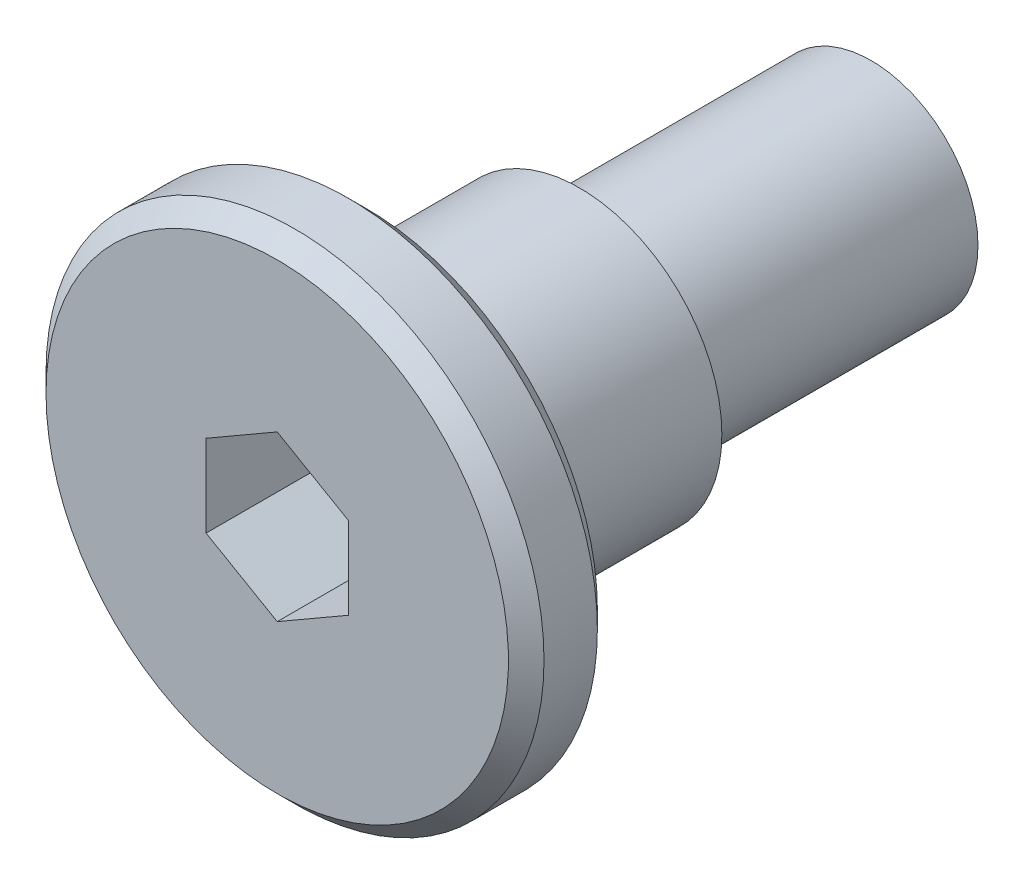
ISO-10303-21;
HEADER;
FILE_DESCRIPTION(('STEP AP214'),'2;1');
FILE_NAME('part.step','',(''),(''),'','','');
FILE_SCHEMA(('AUTOMOTIVE_DESIGN { 1 0 10303 214 1 1 1 1 }'));
ENDSEC;
DATA;
#1=APPLICATION_CONTEXT('core data for automotive mechanical design processes');
#2=APPLICATION_PROTOCOL_DEFINITION('international standard','automotive_design',2000,#1);
#3=PRODUCT_CONTEXT('',#1,'mechanical');
#4=PRODUCT('Part','Part','',(#3));
#5=PRODUCT_RELATED_PRODUCT_CATEGORY('part','',(#4));
#6=PRODUCT_DEFINITION_FORMATION('','',#4);
#7=PRODUCT_DEFINITION_CONTEXT('part definition',#1,'design');
#8=PRODUCT_DEFINITION('design','',#6,#7);
#9=PRODUCT_DEFINITION_SHAPE('','',#8);
#10=(LENGTH_UNIT() NAMED_UNIT(*) SI_UNIT(.MILLI.,.METRE.));
#11=(NAMED_UNIT(*) PLANE_ANGLE_UNIT() SI_UNIT($,.RADIAN.));
#12=(NAMED_UNIT(*) SI_UNIT($,.STERADIAN.) SOLID_ANGLE_UNIT());
#13=UNCERTAINTY_MEASURE_WITH_UNIT(LENGTH_MEASURE(1.E-05),#10,'distance_accuracy_value','');
#14=(GEOMETRIC_REPRESENTATION_CONTEXT(3) GLOBAL_UNCERTAINTY_ASSIGNED_CONTEXT((#13)) GLOBAL_UNIT_ASSIGNED_CONTEXT((#10,
#11,#12)) REPRESENTATION_CONTEXT('',''));
#15=CARTESIAN_POINT('',(0.,0.,0.));
#16=DIRECTION('',(0.,0.,1.));
#17=DIRECTION('',(1.,0.,0.));
#18=AXIS2_PLACEMENT_3D('',#15,#16,#17);
#19=CARTESIAN_POINT('',(0.,0.,0.));
#20=DIRECTION('',(0.,0.,1.));
#21=DIRECTION('',(1.,0.,0.));
#22=AXIS2_PLACEMENT_3D('',#19,#20,#21);
#23=PLANE('',#22);
#24=CARTESIAN_POINT('',(0.,0.,0.));
#25=DIRECTION('',(0.,0.,1.));
#26=DIRECTION('',(1.,0.,0.));
#27=AXIS2_PLACEMENT_3D('',#24,#25,#26);
#28=CIRCLE('',#27,6.5);
#29=CARTESIAN_POINT('',(6.5,0.,0.));
#30=VERTEX_POINT('',#29);
#31=EDGE_CURVE('E125',#30,#30,#28,.F.);
#32=ORIENTED_EDGE('',*,*,#31,.T.);
#33=EDGE_LOOP('',(#32));
#34=FACE_BOUND('',#33,.T.);
#35=CARTESIAN_POINT('',(0.,0.,0.));
#36=DIRECTION('',(0.,0.,-1.));
#37=DIRECTION('',(-1.,0.,0.));
#38=AXIS2_PLACEMENT_3D('',#35,#36,#37);
#39=CIRCLE('',#38,4.);
#40=CARTESIAN_POINT('',(-4.,0.,0.));
#41=VERTEX_POINT('',#40);
#42=EDGE_CURVE('E183',#41,#41,#39,.T.);
#43=ORIENTED_EDGE('',*,*,#42,.F.);
#44=EDGE_LOOP('',(#43));
#45=FACE_BOUND('',#44,.T.);
#46=ADVANCED_FACE('F14',(#34,#45),#23,.F.);
#47=CARTESIAN_POINT('',(0.,0.,2.4));
#48=DIRECTION('',(0.,0.,-1.));
#49=DIRECTION('',(-1.,0.,0.));
#50=AXIS2_PLACEMENT_3D('',#47,#48,#49);
#51=CYLINDRICAL_SURFACE('',#50,7.);
#52=CARTESIAN_POINT('',(0.,0.,0.5));
#53=DIRECTION('',(0.,0.,1.));
#54=DIRECTION('',(1.,0.,0.));
#55=AXIS2_PLACEMENT_3D('',#52,#53,#54);
#56=CIRCLE('',#55,7.);
#57=CARTESIAN_POINT('',(7.,0.,0.5));
#58=VERTEX_POINT('',#57);
#59=EDGE_CURVE('E131',#58,#58,#56,.T.);
#60=ORIENTED_EDGE('',*,*,#59,.T.);
#61=EDGE_LOOP('',(#60));
#62=FACE_BOUND('',#61,.T.);
#63=CARTESIAN_POINT('',(0.,0.,2.));
#64=DIRECTION('',(0.,0.,-1.));
#65=DIRECTION('',(-1.,0.,0.));
#66=AXIS2_PLACEMENT_3D('',#63,#64,#65);
#67=CIRCLE('',#66,7.);
#68=CARTESIAN_POINT('',(-7.,0.,2.));
#69=VERTEX_POINT('',#68);
#70=EDGE_CURVE('E128',#69,#69,#67,.T.);
#71=ORIENTED_EDGE('',*,*,#70,.T.);
#72=EDGE_LOOP('',(#71));
#73=FACE_BOUND('',#72,.T.);
#74=ADVANCED_FACE('F144',(#62,#73),#51,.T.);
#75=CARTESIAN_POINT('',(0.,0.,2.5));
#76=DIRECTION('',(0.,0.,-1.));
#77=DIRECTION('',(-1.,0.,0.));
#78=AXIS2_PLACEMENT_3D('',#75,#76,#77);
#79=PLANE('',#78);
#80=DIRECTION('',(-0.866025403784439,-0.5,0.));
#81=VECTOR('',#80,1.);
#82=CARTESIAN_POINT('',(0.,2.30940107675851,2.5));
#83=LINE('',#82,#81);
#84=CARTESIAN_POINT('',(0.,2.30940107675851,2.5));
#85=VERTEX_POINT('',#84);
#86=CARTESIAN_POINT('',(-2.,1.15470053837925,2.5));
#87=VERTEX_POINT('',#86);
#88=EDGE_CURVE('E103',#85,#87,#83,.T.);
#89=ORIENTED_EDGE('',*,*,#88,.F.);
#90=DIRECTION('',(-0.866025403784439,0.5,0.));
#91=VECTOR('',#90,1.);
#92=CARTESIAN_POINT('',(2.,1.15470053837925,2.5));
#93=LINE('',#92,#91);
#94=CARTESIAN_POINT('',(2.,1.15470053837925,2.5));
#95=VERTEX_POINT('',#94);
#96=EDGE_CURVE('E29',#95,#85,#93,.T.);
#97=ORIENTED_EDGE('',*,*,#96,.F.);
#98=DIRECTION('',(0.,1.,0.));
#99=VECTOR('',#98,1.);
#100=CARTESIAN_POINT('',(2.,-1.15470053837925,2.5));
#101=LINE('',#100,#99);
#102=CARTESIAN_POINT('',(2.,-1.15470053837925,2.5));
#103=VERTEX_POINT('',#102);
#104=EDGE_CURVE('E113',#103,#95,#101,.T.);
#105=ORIENTED_EDGE('',*,*,#104,.F.);
#106=DIRECTION('',(0.866025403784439,0.5,0.));
#107=VECTOR('',#106,1.);
#108=CARTESIAN_POINT('',(0.,-2.30940107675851,2.5));
#109=LINE('',#108,#107);
#110=CARTESIAN_POINT('',(0.,-2.30940107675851,2.5));
#111=VERTEX_POINT('',#110);
#112=EDGE_CURVE('E111',#111,#103,#109,.T.);
#113=ORIENTED_EDGE('',*,*,#112,.F.);
#114=DIRECTION('',(0.866025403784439,-0.5,0.));
#115=VECTOR('',#114,1.);
#116=CARTESIAN_POINT('',(-2.,-1.15470053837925,2.5));
#117=LINE('',#116,#115);
#118=CARTESIAN_POINT('',(-2.,-1.15470053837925,2.5));
#119=VERTEX_POINT('',#118);
#120=EDGE_CURVE('E77',#119,#111,#117,.T.);
#121=ORIENTED_EDGE('',*,*,#120,.F.);
#122=DIRECTION('',(0.,-1.,0.));
#123=VECTOR('',#122,1.);
#124=CARTESIAN_POINT('',(-2.,1.15470053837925,2.5));
#125=LINE('',#124,#123);
#126=EDGE_CURVE('E107',#87,#119,#125,.T.);
#127=ORIENTED_EDGE('',*,*,#126,.F.);
#128=EDGE_LOOP('',(#89,#97,#105,#113,#121,#127));
#129=FACE_BOUND('',#128,.T.);
#130=CARTESIAN_POINT('',(0.,0.,2.5));
#131=DIRECTION('',(0.,0.,-1.));
#132=DIRECTION('',(-1.,0.,0.));
#133=AXIS2_PLACEMENT_3D('',#130,#131,#132);
#134=CIRCLE('',#133,6.5);
#135=CARTESIAN_POINT('',(-6.5,0.,2.5));
#136=VERTEX_POINT('',#135);
#137=EDGE_CURVE('E22',#136,#136,#134,.F.);
#138=ORIENTED_EDGE('',*,*,#137,.T.);
#139=EDGE_LOOP('',(#138));
#140=FACE_BOUND('',#139,.T.);
#141=ADVANCED_FACE('F136',(#129,#140),#79,.F.);
#142=CARTESIAN_POINT('',(0.,0.,0.));
#143=DIRECTION('',(0.,0.,1.));
#144=DIRECTION('',(1.,0.,0.));
#145=AXIS2_PLACEMENT_3D('',#142,#143,#144);
#146=CONICAL_SURFACE('',#145,6.5,0.785398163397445);
#147=ORIENTED_EDGE('',*,*,#59,.F.);
#148=EDGE_LOOP('',(#147));
#149=FACE_BOUND('',#148,.T.);
#150=ORIENTED_EDGE('',*,*,#31,.F.);
#151=EDGE_LOOP('',(#150));
#152=FACE_BOUND('',#151,.T.);
#153=ADVANCED_FACE('F141',(#149,#152),#146,.T.);
#154=CARTESIAN_POINT('',(0.,0.,2.));
#155=DIRECTION('',(0.,0.,-1.));
#156=DIRECTION('',(-1.,0.,0.));
#157=AXIS2_PLACEMENT_3D('',#154,#155,#156);
#158=CONICAL_SURFACE('',#157,7.,0.785398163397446);
#159=ORIENTED_EDGE('',*,*,#137,.F.);
#160=EDGE_LOOP('',(#159));
#161=FACE_BOUND('',#160,.T.);
#162=ORIENTED_EDGE('',*,*,#70,.F.);
#163=EDGE_LOOP('',(#162));
#164=FACE_BOUND('',#163,.T.);
#165=ADVANCED_FACE('F16',(#161,#164),#158,.T.);
#166=CARTESIAN_POINT('',(2.,1.15470053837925,-1.));
#167=DIRECTION('',(0.5,0.866025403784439,0.));
#168=DIRECTION('',(-0.866025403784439,0.5,0.));
#169=AXIS2_PLACEMENT_3D('',#166,#167,#168);
#170=PLANE('',#169);
#171=ORIENTED_EDGE('',*,*,#96,.T.);
#172=DIRECTION('',(0.,0.,1.));
#173=VECTOR('',#172,1.);
#174=CARTESIAN_POINT('',(0.,2.30940107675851,-1.));
#175=LINE('',#174,#173);
#176=CARTESIAN_POINT('',(0.,2.30940107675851,-1.));
#177=VERTEX_POINT('',#176);
#178=EDGE_CURVE('E59',#177,#85,#175,.T.);
#179=ORIENTED_EDGE('',*,*,#178,.F.);
#180=DIRECTION('',(-0.866025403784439,0.5,0.));
#181=VECTOR('',#180,1.);
#182=CARTESIAN_POINT('',(2.,1.15470053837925,-1.));
#183=LINE('',#182,#181);
#184=CARTESIAN_POINT('',(2.,1.15470053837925,-1.));
#185=VERTEX_POINT('',#184);
#186=EDGE_CURVE('E115',#185,#177,#183,.T.);
#187=ORIENTED_EDGE('',*,*,#186,.F.);
#188=DIRECTION('',(0.,0.,1.));
#189=VECTOR('',#188,1.);
#190=CARTESIAN_POINT('',(2.,1.15470053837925,-1.));
#191=LINE('',#190,#189);
#192=EDGE_CURVE('E37',#185,#95,#191,.T.);
#193=ORIENTED_EDGE('',*,*,#192,.T.);
#194=EDGE_LOOP('',(#171,#179,#187,#193));
#195=FACE_BOUND('',#194,.T.);
#196=ADVANCED_FACE('F140',(#195),#170,.F.);
#197=CARTESIAN_POINT('',(2.,-1.15470053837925,-1.));
#198=DIRECTION('',(1.,0.,0.));
#199=DIRECTION('',(0.,0.,-1.));
#200=AXIS2_PLACEMENT_3D('',#197,#198,#199);
#201=PLANE('',#200);
#202=ORIENTED_EDGE('',*,*,#104,.T.);
#203=ORIENTED_EDGE('',*,*,#192,.F.);
#204=DIRECTION('',(0.,1.,0.));
#205=VECTOR('',#204,1.);
#206=CARTESIAN_POINT('',(2.,-1.15470053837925,-1.));
#207=LINE('',#206,#205);
#208=CARTESIAN_POINT('',(2.,-1.15470053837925,-1.));
#209=VERTEX_POINT('',#208);
#210=EDGE_CURVE('E89',#209,#185,#207,.T.);
#211=ORIENTED_EDGE('',*,*,#210,.F.);
#212=DIRECTION('',(0.,0.,1.));
#213=VECTOR('',#212,1.);
#214=CARTESIAN_POINT('',(2.,-1.15470053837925,-1.));
#215=LINE('',#214,#213);
#216=EDGE_CURVE('E81',#209,#103,#215,.T.);
#217=ORIENTED_EDGE('',*,*,#216,.T.);
#218=EDGE_LOOP('',(#202,#203,#211,#217));
#219=FACE_BOUND('',#218,.T.);
#220=ADVANCED_FACE('F196',(#219),#201,.F.);
#221=CARTESIAN_POINT('',(0.,-2.30940107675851,-1.));
#222=DIRECTION('',(0.5,-0.866025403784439,0.));
#223=DIRECTION('',(0.866025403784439,0.5,0.));
#224=AXIS2_PLACEMENT_3D('',#221,#222,#223);
#225=PLANE('',#224);
#226=ORIENTED_EDGE('',*,*,#112,.T.);
#227=ORIENTED_EDGE('',*,*,#216,.F.);
#228=DIRECTION('',(0.866025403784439,0.5,0.));
#229=VECTOR('',#228,1.);
#230=CARTESIAN_POINT('',(0.,-2.30940107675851,-1.));
#231=LINE('',#230,#229);
#232=CARTESIAN_POINT('',(0.,-2.30940107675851,-1.));
#233=VERTEX_POINT('',#232);
#234=EDGE_CURVE('E85',#233,#209,#231,.T.);
#235=ORIENTED_EDGE('',*,*,#234,.F.);
#236=DIRECTION('',(0.,0.,1.));
#237=VECTOR('',#236,1.);
#238=CARTESIAN_POINT('',(0.,-2.30940107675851,-1.));
#239=LINE('',#238,#237);
#240=EDGE_CURVE('E70',#233,#111,#239,.T.);
#241=ORIENTED_EDGE('',*,*,#240,.T.);
#242=EDGE_LOOP('',(#226,#227,#235,#241));
#243=FACE_BOUND('',#242,.T.);
#244=ADVANCED_FACE('F86',(#243),#225,.F.);
#245=CARTESIAN_POINT('',(-2.,-1.15470053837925,-1.));
#246=DIRECTION('',(-0.5,-0.866025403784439,0.));
#247=DIRECTION('',(0.866025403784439,-0.5,0.));
#248=AXIS2_PLACEMENT_3D('',#245,#246,#247);
#249=PLANE('',#248);
#250=ORIENTED_EDGE('',*,*,#120,.T.);
#251=ORIENTED_EDGE('',*,*,#240,.F.);
#252=DIRECTION('',(0.866025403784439,-0.5,0.));
#253=VECTOR('',#252,1.);
#254=CARTESIAN_POINT('',(-2.,-1.15470053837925,-1.));
#255=LINE('',#254,#253);
#256=CARTESIAN_POINT('',(-2.,-1.15470053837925,-1.));
#257=VERTEX_POINT('',#256);
#258=EDGE_CURVE('E74',#257,#233,#255,.T.);
#259=ORIENTED_EDGE('',*,*,#258,.F.);
#260=DIRECTION('',(0.,0.,1.));
#261=VECTOR('',#260,1.);
#262=CARTESIAN_POINT('',(-2.,-1.15470053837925,-1.));
#263=LINE('',#262,#261);
#264=EDGE_CURVE('E82',#257,#119,#263,.T.);
#265=ORIENTED_EDGE('',*,*,#264,.T.);
#266=EDGE_LOOP('',(#250,#251,#259,#265));
#267=FACE_BOUND('',#266,.T.);
#268=ADVANCED_FACE('F72',(#267),#249,.F.);
#269=CARTESIAN_POINT('',(-2.,1.15470053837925,-1.));
#270=DIRECTION('',(-1.,0.,0.));
#271=DIRECTION('',(0.,-1.,0.));
#272=AXIS2_PLACEMENT_3D('',#269,#270,#271);
#273=PLANE('',#272);
#274=ORIENTED_EDGE('',*,*,#126,.T.);
#275=ORIENTED_EDGE('',*,*,#264,.F.);
#276=DIRECTION('',(0.,-1.,0.));
#277=VECTOR('',#276,1.);
#278=CARTESIAN_POINT('',(-2.,1.15470053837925,-1.));
#279=LINE('',#278,#277);
#280=CARTESIAN_POINT('',(-2.,1.15470053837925,-1.));
#281=VERTEX_POINT('',#280);
#282=EDGE_CURVE('E95',#281,#257,#279,.T.);
#283=ORIENTED_EDGE('',*,*,#282,.F.);
#284=DIRECTION('',(0.,0.,1.));
#285=VECTOR('',#284,1.);
#286=CARTESIAN_POINT('',(-2.,1.15470053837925,-1.));
#287=LINE('',#286,#285);
#288=EDGE_CURVE('E120',#281,#87,#287,.T.);
#289=ORIENTED_EDGE('',*,*,#288,.T.);
#290=EDGE_LOOP('',(#274,#275,#283,#289));
#291=FACE_BOUND('',#290,.T.);
#292=ADVANCED_FACE('F194',(#291),#273,.F.);
#293=CARTESIAN_POINT('',(0.,2.30940107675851,-1.));
#294=DIRECTION('',(-0.5,0.866025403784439,0.));
#295=DIRECTION('',(-0.866025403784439,-0.5,0.));
#296=AXIS2_PLACEMENT_3D('',#293,#294,#295);
#297=PLANE('',#296);
#298=ORIENTED_EDGE('',*,*,#88,.T.);
#299=ORIENTED_EDGE('',*,*,#288,.F.);
#300=DIRECTION('',(-0.866025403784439,-0.5,0.));
#301=VECTOR('',#300,1.);
#302=CARTESIAN_POINT('',(0.,2.30940107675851,-1.));
#303=LINE('',#302,#301);
#304=EDGE_CURVE('E97',#177,#281,#303,.T.);
#305=ORIENTED_EDGE('',*,*,#304,.F.);
#306=ORIENTED_EDGE('',*,*,#178,.T.);
#307=EDGE_LOOP('',(#298,#299,#305,#306));
#308=FACE_BOUND('',#307,.T.);
#309=ADVANCED_FACE('F190',(#308),#297,.F.);
#310=CARTESIAN_POINT('',(0.,0.,-1.));
#311=DIRECTION('',(0.,0.,1.));
#312=DIRECTION('',(1.,0.,0.));
#313=AXIS2_PLACEMENT_3D('',#310,#311,#312);
#314=PLANE('',#313);
#315=ORIENTED_EDGE('',*,*,#186,.T.);
#316=ORIENTED_EDGE('',*,*,#304,.T.);
#317=ORIENTED_EDGE('',*,*,#282,.T.);
#318=ORIENTED_EDGE('',*,*,#258,.T.);
#319=ORIENTED_EDGE('',*,*,#234,.T.);
#320=ORIENTED_EDGE('',*,*,#210,.T.);
#321=EDGE_LOOP('',(#315,#316,#317,#318,#319,#320));
#322=FACE_BOUND('',#321,.T.);
#323=ADVANCED_FACE('F92',(#322),#314,.T.);
#324=CARTESIAN_POINT('',(0.,0.,-14.2));
#325=DIRECTION('',(0.,0.,-1.));
#326=DIRECTION('',(-1.,0.,0.));
#327=AXIS2_PLACEMENT_3D('',#324,#325,#326);
#328=PLANE('',#327);
#329=CARTESIAN_POINT('',(0.,0.,-14.2));
#330=DIRECTION('',(0.,0.,-1.));
#331=DIRECTION('',(-1.,0.,0.));
#332=AXIS2_PLACEMENT_3D('',#329,#330,#331);
#333=CIRCLE('',#332,3.);
#334=CARTESIAN_POINT('',(-3.,0.,-14.2));
#335=VERTEX_POINT('',#334);
#336=EDGE_CURVE('E104',#335,#335,#333,.T.);
#337=ORIENTED_EDGE('',*,*,#336,.T.);
#338=EDGE_LOOP('',(#337));
#339=FACE_BOUND('',#338,.T.);
#340=ADVANCED_FACE('F169',(#339),#328,.T.);
#341=CARTESIAN_POINT('',(0.,0.,2.48528137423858));
#342=DIRECTION('',(0.,0.,-1.));
#343=DIRECTION('',(-1.,0.,0.));
#344=AXIS2_PLACEMENT_3D('',#341,#342,#343);
#345=CYLINDRICAL_SURFACE('',#344,3.);
#346=CARTESIAN_POINT('',(0.,0.,-6.));
#347=DIRECTION('',(0.,0.,-1.));
#348=DIRECTION('',(-1.,0.,0.));
#349=AXIS2_PLACEMENT_3D('',#346,#347,#348);
#350=CIRCLE('',#349,3.);
#351=CARTESIAN_POINT('',(-3.,0.,-6.));
#352=VERTEX_POINT('',#351);
#353=EDGE_CURVE('E9',#352,#352,#350,.T.);
#354=ORIENTED_EDGE('',*,*,#353,.T.);
#355=EDGE_LOOP('',(#354));
#356=FACE_BOUND('',#355,.T.);
#357=ORIENTED_EDGE('',*,*,#336,.F.);
#358=EDGE_LOOP('',(#357));
#359=FACE_BOUND('',#358,.T.);
#360=ADVANCED_FACE('F167',(#356,#359),#345,.T.);
#361=CARTESIAN_POINT('',(0.,0.,-6.));
#362=DIRECTION('',(0.,0.,-1.));
#363=DIRECTION('',(-1.,0.,0.));
#364=AXIS2_PLACEMENT_3D('',#361,#362,#363);
#365=PLANE('',#364);
#366=ORIENTED_EDGE('',*,*,#353,.F.);
#367=EDGE_LOOP('',(#366));
#368=FACE_BOUND('',#367,.T.);
#369=CARTESIAN_POINT('',(0.,0.,-6.));
#370=DIRECTION('',(0.,0.,1.));
#371=DIRECTION('',(1.,0.,0.));
#372=AXIS2_PLACEMENT_3D('',#369,#370,#371);
#373=CIRCLE('',#372,4.);
#374=CARTESIAN_POINT('',(4.,0.,-6.));
#375=VERTEX_POINT('',#374);
#376=EDGE_CURVE('E117',#375,#375,#373,.T.);
#377=ORIENTED_EDGE('',*,*,#376,.F.);
#378=EDGE_LOOP('',(#377));
#379=FACE_BOUND('',#378,.T.);
#380=ADVANCED_FACE('F163',(#368,#379),#365,.T.);
#381=CARTESIAN_POINT('',(0.,0.,-6.));
#382=DIRECTION('',(0.,0.,1.));
#383=DIRECTION('',(1.,0.,0.));
#384=AXIS2_PLACEMENT_3D('',#381,#382,#383);
#385=CYLINDRICAL_SURFACE('',#384,4.);
#386=ORIENTED_EDGE('',*,*,#376,.T.);
#387=EDGE_LOOP('',(#386));
#388=FACE_BOUND('',#387,.T.);
#389=ORIENTED_EDGE('',*,*,#42,.T.);
#390=EDGE_LOOP('',(#389));
#391=FACE_BOUND('',#390,.T.);
#392=ADVANCED_FACE('F160',(#388,#391),#385,.T.);
#393=CLOSED_SHELL('',(#46,#74,#141,#153,#165,#196,#220,#244,#268,#292,#309,#323,#340,#360,#380,#392));
#394=MANIFOLD_SOLID_BREP('B1',#393);
#395=ADVANCED_BREP_SHAPE_REPRESENTATION('',(#18,#394),#14);
#396=SHAPE_DEFINITION_REPRESENTATION(#9,#395);
ENDSEC;
END-ISO-10303-21;
